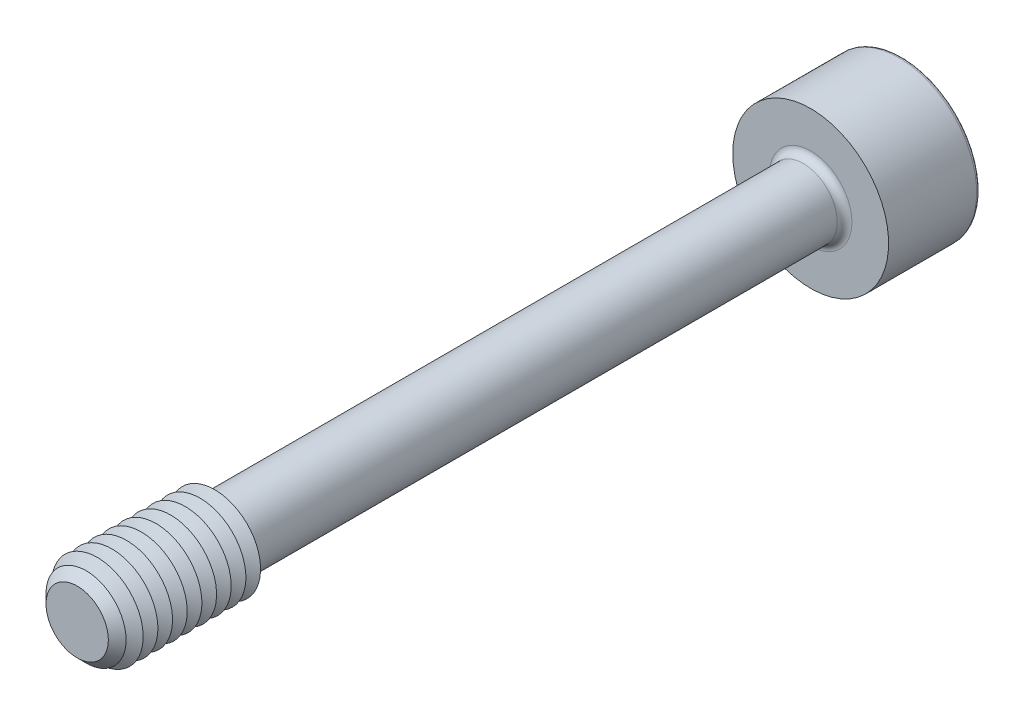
ISO-10303-21;
HEADER;
FILE_DESCRIPTION(('STEP AP214'),'2;1');
FILE_NAME('part.step','',(''),(''),'','','');
FILE_SCHEMA(('AUTOMOTIVE_DESIGN { 1 0 10303 214 1 1 1 1 }'));
ENDSEC;
DATA;
#1=APPLICATION_CONTEXT('core data for automotive mechanical design processes');
#2=APPLICATION_PROTOCOL_DEFINITION('international standard','automotive_design',2000,#1);
#3=PRODUCT_CONTEXT('',#1,'mechanical');
#4=PRODUCT('Part','Part','',(#3));
#5=PRODUCT_RELATED_PRODUCT_CATEGORY('part','',(#4));
#6=PRODUCT_DEFINITION_FORMATION('','',#4);
#7=PRODUCT_DEFINITION_CONTEXT('part definition',#1,'design');
#8=PRODUCT_DEFINITION('design','',#6,#7);
#9=PRODUCT_DEFINITION_SHAPE('','',#8);
#10=(LENGTH_UNIT() NAMED_UNIT(*) SI_UNIT(.MILLI.,.METRE.));
#11=(NAMED_UNIT(*) PLANE_ANGLE_UNIT() SI_UNIT($,.RADIAN.));
#12=(NAMED_UNIT(*) SI_UNIT($,.STERADIAN.) SOLID_ANGLE_UNIT());
#13=UNCERTAINTY_MEASURE_WITH_UNIT(LENGTH_MEASURE(1.E-05),#10,'distance_accuracy_value','');
#14=(GEOMETRIC_REPRESENTATION_CONTEXT(3) GLOBAL_UNCERTAINTY_ASSIGNED_CONTEXT((#13)) GLOBAL_UNIT_ASSIGNED_CONTEXT((#10,
#11,#12)) REPRESENTATION_CONTEXT('',''));
#15=CARTESIAN_POINT('',(0.,0.,0.));
#16=DIRECTION('',(0.,0.,1.));
#17=DIRECTION('',(1.,0.,0.));
#18=AXIS2_PLACEMENT_3D('',#15,#16,#17);
#19=CARTESIAN_POINT('',(-1.15470053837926,-2.,-21.));
#20=DIRECTION('',(0.,0.,1.));
#21=DIRECTION('',(1.,0.,0.));
#22=AXIS2_PLACEMENT_3D('',#19,#20,#21);
#23=PLANE('',#22);
#24=DIRECTION('',(1.,0.,0.));
#25=VECTOR('',#24,1.);
#26=CARTESIAN_POINT('',(-1.15470053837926,-2.,-21.));
#27=LINE('',#26,#25);
#28=CARTESIAN_POINT('',(0.,-2.,-21.));
#29=VERTEX_POINT('',#28);
#30=CARTESIAN_POINT('',(1.15470053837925,-2.,-21.));
#31=VERTEX_POINT('',#30);
#32=EDGE_CURVE('E794',#29,#31,#27,.T.);
#33=ORIENTED_EDGE('',*,*,#32,.F.);
#34=CARTESIAN_POINT('',(0.,0.,-21.));
#35=DIRECTION('',(0.,0.,1.));
#36=DIRECTION('',(0.,-1.,0.));
#37=AXIS2_PLACEMENT_3D('',#34,#35,#36);
#38=CIRCLE('',#37,2.);
#39=CARTESIAN_POINT('',(1.73205080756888,-0.999999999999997,-21.));
#40=VERTEX_POINT('',#39);
#41=EDGE_CURVE('E53',#29,#40,#38,.T.);
#42=ORIENTED_EDGE('',*,*,#41,.T.);
#43=DIRECTION('',(0.5,0.866025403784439,0.));
#44=VECTOR('',#43,1.);
#45=CARTESIAN_POINT('',(1.15470053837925,-2.,-21.));
#46=LINE('',#45,#44);
#47=EDGE_CURVE('E780',#31,#40,#46,.T.);
#48=ORIENTED_EDGE('',*,*,#47,.F.);
#49=EDGE_LOOP('',(#33,#42,#48));
#50=FACE_BOUND('',#49,.T.);
#51=ADVANCED_FACE('F41',(#50),#23,.F.);
#52=CARTESIAN_POINT('',(2.3094010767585,0.,-21.));
#53=VERTEX_POINT('',#52);
#54=EDGE_CURVE('E791',#40,#53,#46,.T.);
#55=ORIENTED_EDGE('',*,*,#54,.F.);
#56=CARTESIAN_POINT('',(1.73205080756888,1.,-21.));
#57=VERTEX_POINT('',#56);
#58=EDGE_CURVE('E11',#40,#57,#38,.T.);
#59=ORIENTED_EDGE('',*,*,#58,.T.);
#60=DIRECTION('',(-0.499999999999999,0.866025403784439,0.));
#61=VECTOR('',#60,1.);
#62=CARTESIAN_POINT('',(2.3094010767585,0.,-21.));
#63=LINE('',#62,#61);
#64=EDGE_CURVE('E779',#53,#57,#63,.T.);
#65=ORIENTED_EDGE('',*,*,#64,.F.);
#66=EDGE_LOOP('',(#55,#59,#65));
#67=FACE_BOUND('',#66,.T.);
#68=ADVANCED_FACE('F133',(#67),#23,.F.);
#69=CARTESIAN_POINT('',(1.15470053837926,2.,-21.));
#70=VERTEX_POINT('',#69);
#71=EDGE_CURVE('E774',#57,#70,#63,.T.);
#72=ORIENTED_EDGE('',*,*,#71,.F.);
#73=CARTESIAN_POINT('',(0.,2.00000000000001,-21.));
#74=VERTEX_POINT('',#73);
#75=EDGE_CURVE('E51',#57,#74,#38,.T.);
#76=ORIENTED_EDGE('',*,*,#75,.T.);
#77=DIRECTION('',(-1.,0.,0.));
#78=VECTOR('',#77,1.);
#79=CARTESIAN_POINT('',(1.15470053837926,2.,-21.));
#80=LINE('',#79,#78);
#81=EDGE_CURVE('E177',#70,#74,#80,.T.);
#82=ORIENTED_EDGE('',*,*,#81,.F.);
#83=EDGE_LOOP('',(#72,#76,#82));
#84=FACE_BOUND('',#83,.T.);
#85=ADVANCED_FACE('F139',(#84),#23,.F.);
#86=CARTESIAN_POINT('',(-1.15470053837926,2.,-21.));
#87=VERTEX_POINT('',#86);
#88=EDGE_CURVE('E785',#74,#87,#80,.T.);
#89=ORIENTED_EDGE('',*,*,#88,.F.);
#90=CARTESIAN_POINT('',(-1.73205080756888,1.00000000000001,-21.));
#91=VERTEX_POINT('',#90);
#92=EDGE_CURVE('E264',#74,#91,#38,.T.);
#93=ORIENTED_EDGE('',*,*,#92,.T.);
#94=DIRECTION('',(-0.5,-0.866025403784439,0.));
#95=VECTOR('',#94,1.);
#96=CARTESIAN_POINT('',(-1.15470053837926,2.,-21.));
#97=LINE('',#96,#95);
#98=EDGE_CURVE('E176',#87,#91,#97,.T.);
#99=ORIENTED_EDGE('',*,*,#98,.F.);
#100=EDGE_LOOP('',(#89,#93,#99));
#101=FACE_BOUND('',#100,.T.);
#102=ADVANCED_FACE('F157',(#101),#23,.F.);
#103=CARTESIAN_POINT('',(-2.30940107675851,0.,-21.));
#104=VERTEX_POINT('',#103);
#105=EDGE_CURVE('E170',#91,#104,#97,.T.);
#106=ORIENTED_EDGE('',*,*,#105,.F.);
#107=CARTESIAN_POINT('',(-1.73205080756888,-0.999999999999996,-21.));
#108=VERTEX_POINT('',#107);
#109=EDGE_CURVE('E172',#91,#108,#38,.T.);
#110=ORIENTED_EDGE('',*,*,#109,.T.);
#111=DIRECTION('',(0.5,-0.866025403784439,0.));
#112=VECTOR('',#111,1.);
#113=CARTESIAN_POINT('',(-2.30940107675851,0.,-21.));
#114=LINE('',#113,#112);
#115=EDGE_CURVE('E174',#104,#108,#114,.T.);
#116=ORIENTED_EDGE('',*,*,#115,.F.);
#117=EDGE_LOOP('',(#106,#110,#116));
#118=FACE_BOUND('',#117,.T.);
#119=ADVANCED_FACE('F146',(#118),#23,.F.);
#120=CARTESIAN_POINT('',(0.,0.,-25.));
#121=DIRECTION('',(0.,0.,-1.));
#122=DIRECTION('',(-1.,0.,0.));
#123=AXIS2_PLACEMENT_3D('',#120,#121,#122);
#124=PLANE('',#123);
#125=CARTESIAN_POINT('',(0.,0.,-25.));
#126=DIRECTION('',(0.,0.,-1.));
#127=DIRECTION('',(-1.,0.,0.));
#128=AXIS2_PLACEMENT_3D('',#125,#126,#127);
#129=CIRCLE('',#128,4.05);
#130=CARTESIAN_POINT('',(-4.05,0.,-25.));
#131=VERTEX_POINT('',#130);
#132=EDGE_CURVE('E251',#131,#131,#129,.T.);
#133=ORIENTED_EDGE('',*,*,#132,.T.);
#134=EDGE_LOOP('',(#133));
#135=FACE_BOUND('',#134,.T.);
#136=DIRECTION('',(-0.5,-0.866025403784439,0.));
#137=VECTOR('',#136,1.);
#138=CARTESIAN_POINT('',(-1.15470053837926,2.,-25.));
#139=LINE('',#138,#137);
#140=CARTESIAN_POINT('',(-1.15470053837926,2.,-25.));
#141=VERTEX_POINT('',#140);
#142=CARTESIAN_POINT('',(-2.30940107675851,0.,-25.));
#143=VERTEX_POINT('',#142);
#144=EDGE_CURVE('E212',#141,#143,#139,.T.);
#145=ORIENTED_EDGE('',*,*,#144,.T.);
#146=DIRECTION('',(0.5,-0.866025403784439,0.));
#147=VECTOR('',#146,1.);
#148=CARTESIAN_POINT('',(-2.30940107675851,0.,-25.));
#149=LINE('',#148,#147);
#150=CARTESIAN_POINT('',(-1.15470053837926,-2.,-25.));
#151=VERTEX_POINT('',#150);
#152=EDGE_CURVE('E67',#143,#151,#149,.T.);
#153=ORIENTED_EDGE('',*,*,#152,.T.);
#154=DIRECTION('',(1.,0.,0.));
#155=VECTOR('',#154,1.);
#156=CARTESIAN_POINT('',(-1.15470053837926,-2.,-25.));
#157=LINE('',#156,#155);
#158=CARTESIAN_POINT('',(1.15470053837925,-2.,-25.));
#159=VERTEX_POINT('',#158);
#160=EDGE_CURVE('E196',#151,#159,#157,.T.);
#161=ORIENTED_EDGE('',*,*,#160,.T.);
#162=DIRECTION('',(0.5,0.866025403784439,0.));
#163=VECTOR('',#162,1.);
#164=CARTESIAN_POINT('',(1.15470053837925,-2.,-25.));
#165=LINE('',#164,#163);
#166=CARTESIAN_POINT('',(2.3094010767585,0.,-25.));
#167=VERTEX_POINT('',#166);
#168=EDGE_CURVE('E200',#159,#167,#165,.T.);
#169=ORIENTED_EDGE('',*,*,#168,.T.);
#170=DIRECTION('',(-0.499999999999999,0.866025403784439,0.));
#171=VECTOR('',#170,1.);
#172=CARTESIAN_POINT('',(2.3094010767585,0.,-25.));
#173=LINE('',#172,#171);
#174=CARTESIAN_POINT('',(1.15470053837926,2.,-25.));
#175=VERTEX_POINT('',#174);
#176=EDGE_CURVE('E204',#167,#175,#173,.T.);
#177=ORIENTED_EDGE('',*,*,#176,.T.);
#178=DIRECTION('',(-1.,0.,0.));
#179=VECTOR('',#178,1.);
#180=CARTESIAN_POINT('',(1.15470053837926,2.,-25.));
#181=LINE('',#180,#179);
#182=EDGE_CURVE('E208',#175,#141,#181,.T.);
#183=ORIENTED_EDGE('',*,*,#182,.T.);
#184=EDGE_LOOP('',(#145,#153,#161,#169,#177,#183));
#185=FACE_BOUND('',#184,.T.);
#186=ADVANCED_FACE('F156',(#135,#185),#124,.T.);
#187=CARTESIAN_POINT('',(0.,0.,20.));
#188=DIRECTION('',(0.,0.,-1.));
#189=DIRECTION('',(-1.,0.,0.));
#190=AXIS2_PLACEMENT_3D('',#187,#188,#189);
#191=CYLINDRICAL_SURFACE('',#190,1.85);
#192=CARTESIAN_POINT('',(0.,0.,-19.6));
#193=DIRECTION('',(0.,0.,-1.));
#194=DIRECTION('',(-1.,0.,0.));
#195=AXIS2_PLACEMENT_3D('',#192,#193,#194);
#196=CIRCLE('',#195,1.85);
#197=CARTESIAN_POINT('',(-1.85,0.,-19.6));
#198=VERTEX_POINT('',#197);
#199=EDGE_CURVE('E247',#198,#198,#196,.F.);
#200=ORIENTED_EDGE('',*,*,#199,.T.);
#201=EDGE_LOOP('',(#200));
#202=FACE_BOUND('',#201,.T.);
#203=CARTESIAN_POINT('',(0.,0.,12.1247223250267));
#204=DIRECTION('',(0.,0.,-1.));
#205=DIRECTION('',(0.,1.,0.));
#206=AXIS2_PLACEMENT_3D('',#203,#204,#205);
#207=CIRCLE('',#206,1.85);
#208=CARTESIAN_POINT('',(0.,1.85,12.1247223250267));
#209=VERTEX_POINT('',#208);
#210=EDGE_CURVE('E235',#209,#209,#207,.T.);
#211=ORIENTED_EDGE('',*,*,#210,.T.);
#212=EDGE_LOOP('',(#211));
#213=FACE_BOUND('',#212,.T.);
#214=ADVANCED_FACE('F163',(#202,#213),#191,.T.);
#215=CARTESIAN_POINT('',(0.,0.,12.1247223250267));
#216=DIRECTION('',(0.,0.,1.));
#217=DIRECTION('',(0.,-1.,0.));
#218=AXIS2_PLACEMENT_3D('',#215,#216,#217);
#219=CONICAL_SURFACE('',#218,1.85,1.0471975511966);
#220=CARTESIAN_POINT('',(0.,0.,12.5));
#221=DIRECTION('',(0.,0.,-1.));
#222=DIRECTION('',(-1.,0.,0.));
#223=AXIS2_PLACEMENT_3D('',#220,#221,#222);
#224=CIRCLE('',#223,2.5);
#225=CARTESIAN_POINT('',(-2.5,0.,12.5));
#226=VERTEX_POINT('',#225);
#227=EDGE_CURVE('E268',#226,#226,#224,.T.);
#228=ORIENTED_EDGE('',*,*,#227,.T.);
#229=EDGE_LOOP('',(#228));
#230=FACE_BOUND('',#229,.T.);
#231=ORIENTED_EDGE('',*,*,#210,.F.);
#232=EDGE_LOOP('',(#231));
#233=FACE_BOUND('',#232,.T.);
#234=ADVANCED_FACE('F535',(#230,#233),#219,.T.);
#235=CARTESIAN_POINT('',(0.,0.,-20.));
#236=DIRECTION('',(0.,0.,-1.));
#237=DIRECTION('',(-1.,0.,0.));
#238=AXIS2_PLACEMENT_3D('',#235,#236,#237);
#239=PLANE('',#238);
#240=CARTESIAN_POINT('',(0.,0.,-20.));
#241=DIRECTION('',(0.,0.,-1.));
#242=DIRECTION('',(-1.,0.,0.));
#243=AXIS2_PLACEMENT_3D('',#240,#241,#242);
#244=CIRCLE('',#243,2.25);
#245=CARTESIAN_POINT('',(-2.25,0.,-20.));
#246=VERTEX_POINT('',#245);
#247=EDGE_CURVE('E243',#246,#246,#244,.T.);
#248=ORIENTED_EDGE('',*,*,#247,.T.);
#249=EDGE_LOOP('',(#248));
#250=FACE_BOUND('',#249,.T.);
#251=CARTESIAN_POINT('',(0.,0.,-20.));
#252=DIRECTION('',(0.,0.,-1.));
#253=DIRECTION('',(-1.,0.,0.));
#254=AXIS2_PLACEMENT_3D('',#251,#252,#253);
#255=CIRCLE('',#254,4.25);
#256=CARTESIAN_POINT('',(-4.25,0.,-20.));
#257=VERTEX_POINT('',#256);
#258=EDGE_CURVE('E231',#257,#257,#255,.T.);
#259=ORIENTED_EDGE('',*,*,#258,.F.);
#260=EDGE_LOOP('',(#259));
#261=FACE_BOUND('',#260,.T.);
#262=ADVANCED_FACE('F528',(#250,#261),#239,.F.);
#263=CARTESIAN_POINT('',(0.,0.,-25.));
#264=DIRECTION('',(0.,0.,1.));
#265=DIRECTION('',(1.,0.,0.));
#266=AXIS2_PLACEMENT_3D('',#263,#264,#265);
#267=CYLINDRICAL_SURFACE('',#266,4.25);
#268=CARTESIAN_POINT('',(0.,0.,-24.8));
#269=DIRECTION('',(0.,0.,-1.));
#270=DIRECTION('',(-1.,0.,0.));
#271=AXIS2_PLACEMENT_3D('',#268,#269,#270);
#272=CIRCLE('',#271,4.25);
#273=CARTESIAN_POINT('',(-4.25,0.,-24.8));
#274=VERTEX_POINT('',#273);
#275=EDGE_CURVE('E254',#274,#274,#272,.F.);
#276=ORIENTED_EDGE('',*,*,#275,.T.);
#277=EDGE_LOOP('',(#276));
#278=FACE_BOUND('',#277,.T.);
#279=ORIENTED_EDGE('',*,*,#258,.T.);
#280=EDGE_LOOP('',(#279));
#281=FACE_BOUND('',#280,.T.);
#282=ADVANCED_FACE('F534',(#278,#281),#267,.T.);
#283=CARTESIAN_POINT('',(-2.30940107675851,0.,-21.));
#284=DIRECTION('',(0.866025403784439,0.5,0.));
#285=DIRECTION('',(-0.5,0.866025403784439,0.));
#286=AXIS2_PLACEMENT_3D('',#283,#284,#285);
#287=PLANE('',#286);
#288=ORIENTED_EDGE('',*,*,#152,.F.);
#289=DIRECTION('',(0.,0.,-1.));
#290=VECTOR('',#289,1.);
#291=CARTESIAN_POINT('',(-2.30940107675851,0.,-21.));
#292=LINE('',#291,#290);
#293=EDGE_CURVE('E186',#104,#143,#292,.T.);
#294=ORIENTED_EDGE('',*,*,#293,.F.);
#295=ORIENTED_EDGE('',*,*,#115,.T.);
#296=CARTESIAN_POINT('',(-1.15470053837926,-2.,-21.));
#297=VERTEX_POINT('',#296);
#298=EDGE_CURVE('E215',#108,#297,#114,.T.);
#299=ORIENTED_EDGE('',*,*,#298,.T.);
#300=DIRECTION('',(0.,0.,-1.));
#301=VECTOR('',#300,1.);
#302=CARTESIAN_POINT('',(-1.15470053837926,-2.,-21.));
#303=LINE('',#302,#301);
#304=EDGE_CURVE('E228',#297,#151,#303,.T.);
#305=ORIENTED_EDGE('',*,*,#304,.T.);
#306=EDGE_LOOP('',(#288,#294,#295,#299,#305));
#307=FACE_BOUND('',#306,.T.);
#308=ADVANCED_FACE('F546',(#307),#287,.T.);
#309=CARTESIAN_POINT('',(-1.15470053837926,-2.,-21.));
#310=DIRECTION('',(0.,1.,0.));
#311=DIRECTION('',(-1.,0.,0.));
#312=AXIS2_PLACEMENT_3D('',#309,#310,#311);
#313=PLANE('',#312);
#314=ORIENTED_EDGE('',*,*,#160,.F.);
#315=ORIENTED_EDGE('',*,*,#304,.F.);
#316=EDGE_CURVE('E792',#297,#29,#27,.T.);
#317=ORIENTED_EDGE('',*,*,#316,.T.);
#318=ORIENTED_EDGE('',*,*,#32,.T.);
#319=DIRECTION('',(0.,0.,-1.));
#320=VECTOR('',#319,1.);
#321=CARTESIAN_POINT('',(1.15470053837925,-2.,-21.));
#322=LINE('',#321,#320);
#323=EDGE_CURVE('E225',#31,#159,#322,.T.);
#324=ORIENTED_EDGE('',*,*,#323,.T.);
#325=EDGE_LOOP('',(#314,#315,#317,#318,#324));
#326=FACE_BOUND('',#325,.T.);
#327=ADVANCED_FACE('F562',(#326),#313,.T.);
#328=CARTESIAN_POINT('',(1.15470053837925,-2.,-21.));
#329=DIRECTION('',(-0.866025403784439,0.5,0.));
#330=DIRECTION('',(-0.5,-0.866025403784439,0.));
#331=AXIS2_PLACEMENT_3D('',#328,#329,#330);
#332=PLANE('',#331);
#333=ORIENTED_EDGE('',*,*,#168,.F.);
#334=ORIENTED_EDGE('',*,*,#323,.F.);
#335=ORIENTED_EDGE('',*,*,#47,.T.);
#336=ORIENTED_EDGE('',*,*,#54,.T.);
#337=DIRECTION('',(0.,0.,-1.));
#338=VECTOR('',#337,1.);
#339=CARTESIAN_POINT('',(2.3094010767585,0.,-21.));
#340=LINE('',#339,#338);
#341=EDGE_CURVE('E222',#53,#167,#340,.T.);
#342=ORIENTED_EDGE('',*,*,#341,.T.);
#343=EDGE_LOOP('',(#333,#334,#335,#336,#342));
#344=FACE_BOUND('',#343,.T.);
#345=ADVANCED_FACE('F572',(#344),#332,.T.);
#346=CARTESIAN_POINT('',(2.3094010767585,0.,-21.));
#347=DIRECTION('',(-0.866025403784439,-0.499999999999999,0.));
#348=DIRECTION('',(0.499999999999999,-0.866025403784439,0.));
#349=AXIS2_PLACEMENT_3D('',#346,#347,#348);
#350=PLANE('',#349);
#351=ORIENTED_EDGE('',*,*,#176,.F.);
#352=ORIENTED_EDGE('',*,*,#341,.F.);
#353=ORIENTED_EDGE('',*,*,#64,.T.);
#354=ORIENTED_EDGE('',*,*,#71,.T.);
#355=DIRECTION('',(0.,0.,-1.));
#356=VECTOR('',#355,1.);
#357=CARTESIAN_POINT('',(1.15470053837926,2.,-21.));
#358=LINE('',#357,#356);
#359=EDGE_CURVE('E219',#70,#175,#358,.T.);
#360=ORIENTED_EDGE('',*,*,#359,.T.);
#361=EDGE_LOOP('',(#351,#352,#353,#354,#360));
#362=FACE_BOUND('',#361,.T.);
#363=ADVANCED_FACE('F582',(#362),#350,.T.);
#364=CARTESIAN_POINT('',(1.15470053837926,2.,-21.));
#365=DIRECTION('',(0.,-1.,0.));
#366=DIRECTION('',(0.,0.,-1.));
#367=AXIS2_PLACEMENT_3D('',#364,#365,#366);
#368=PLANE('',#367);
#369=ORIENTED_EDGE('',*,*,#182,.F.);
#370=ORIENTED_EDGE('',*,*,#359,.F.);
#371=ORIENTED_EDGE('',*,*,#81,.T.);
#372=ORIENTED_EDGE('',*,*,#88,.T.);
#373=DIRECTION('',(0.,0.,-1.));
#374=VECTOR('',#373,1.);
#375=CARTESIAN_POINT('',(-1.15470053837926,2.,-21.));
#376=LINE('',#375,#374);
#377=EDGE_CURVE('E182',#87,#141,#376,.T.);
#378=ORIENTED_EDGE('',*,*,#377,.T.);
#379=EDGE_LOOP('',(#369,#370,#371,#372,#378));
#380=FACE_BOUND('',#379,.T.);
#381=ADVANCED_FACE('F152',(#380),#368,.T.);
#382=CARTESIAN_POINT('',(-1.15470053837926,2.,-21.));
#383=DIRECTION('',(0.866025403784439,-0.5,0.));
#384=DIRECTION('',(0.5,0.866025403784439,0.));
#385=AXIS2_PLACEMENT_3D('',#382,#383,#384);
#386=PLANE('',#385);
#387=ORIENTED_EDGE('',*,*,#144,.F.);
#388=ORIENTED_EDGE('',*,*,#377,.F.);
#389=ORIENTED_EDGE('',*,*,#98,.T.);
#390=ORIENTED_EDGE('',*,*,#105,.T.);
#391=ORIENTED_EDGE('',*,*,#293,.T.);
#392=EDGE_LOOP('',(#387,#388,#389,#390,#391));
#393=FACE_BOUND('',#392,.T.);
#394=ADVANCED_FACE('F144',(#393),#386,.T.);
#395=ORIENTED_EDGE('',*,*,#298,.F.);
#396=EDGE_CURVE('E257',#108,#29,#38,.T.);
#397=ORIENTED_EDGE('',*,*,#396,.T.);
#398=ORIENTED_EDGE('',*,*,#316,.F.);
#399=EDGE_LOOP('',(#395,#397,#398));
#400=FACE_BOUND('',#399,.T.);
#401=ADVANCED_FACE('F135',(#400),#23,.F.);
#402=CARTESIAN_POINT('',(0.,0.,-19.6));
#403=DIRECTION('',(0.,0.,-1.));
#404=DIRECTION('',(-1.,0.,0.));
#405=AXIS2_PLACEMENT_3D('',#402,#403,#404);
#406=TOROIDAL_SURFACE('',#405,2.25,0.4);
#407=ORIENTED_EDGE('',*,*,#199,.F.);
#408=EDGE_LOOP('',(#407));
#409=FACE_BOUND('',#408,.T.);
#410=ORIENTED_EDGE('',*,*,#247,.F.);
#411=EDGE_LOOP('',(#410));
#412=FACE_BOUND('',#411,.T.);
#413=ADVANCED_FACE('F129',(#409,#412),#406,.F.);
#414=CARTESIAN_POINT('',(0.,0.,-24.8));
#415=DIRECTION('',(0.,0.,-1.));
#416=DIRECTION('',(-1.,0.,0.));
#417=AXIS2_PLACEMENT_3D('',#414,#415,#416);
#418=TOROIDAL_SURFACE('',#417,4.05,0.2);
#419=ORIENTED_EDGE('',*,*,#275,.F.);
#420=EDGE_LOOP('',(#419));
#421=FACE_BOUND('',#420,.T.);
#422=ORIENTED_EDGE('',*,*,#132,.F.);
#423=EDGE_LOOP('',(#422));
#424=FACE_BOUND('',#423,.T.);
#425=ADVANCED_FACE('F43',(#421,#424),#418,.T.);
#426=CARTESIAN_POINT('',(0.,0.,-19.8452994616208));
#427=DIRECTION('',(0.,0.,-1.));
#428=DIRECTION('',(0.,1.,0.));
#429=AXIS2_PLACEMENT_3D('',#426,#427,#428);
#430=CONICAL_SURFACE('',#429,0.,1.04719755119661);
#431=ORIENTED_EDGE('',*,*,#41,.F.);
#432=ORIENTED_EDGE('',*,*,#396,.F.);
#433=ORIENTED_EDGE('',*,*,#109,.F.);
#434=ORIENTED_EDGE('',*,*,#92,.F.);
#435=ORIENTED_EDGE('',*,*,#75,.F.);
#436=ORIENTED_EDGE('',*,*,#58,.F.);
#437=EDGE_LOOP('',(#431,#432,#433,#434,#435,#436));
#438=FACE_BOUND('',#437,.T.);
#439=CARTESIAN_POINT('',(0.,0.,-19.8452994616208));
#440=VERTEX_POINT('',#439);
#441=VERTEX_LOOP('',#440);
#442=FACE_BOUND('',#441,.T.);
#443=ADVANCED_FACE('F118',(#438,#442),#430,.F.);
#444=CARTESIAN_POINT('',(0.,0.,12.9));
#445=DIRECTION('',(0.,0.,-1.));
#446=DIRECTION('',(-1.,0.,0.));
#447=AXIS2_PLACEMENT_3D('',#444,#445,#446);
#448=CONICAL_SURFACE('',#447,1.80717967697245,1.0471975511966);
#449=ORIENTED_EDGE('',*,*,#227,.F.);
#450=EDGE_LOOP('',(#449));
#451=FACE_BOUND('',#450,.T.);
#452=CARTESIAN_POINT('',(0.,0.,12.9));
#453=DIRECTION('',(0.,0.,-1.));
#454=DIRECTION('',(-1.,0.,0.));
#455=AXIS2_PLACEMENT_3D('',#452,#453,#454);
#456=CIRCLE('',#455,1.80717967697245);
#457=CARTESIAN_POINT('',(-1.80717967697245,0.,12.9));
#458=VERTEX_POINT('',#457);
#459=EDGE_CURVE('E272',#458,#458,#456,.T.);
#460=ORIENTED_EDGE('',*,*,#459,.T.);
#461=EDGE_LOOP('',(#460));
#462=FACE_BOUND('',#461,.T.);
#463=ADVANCED_FACE('F120',(#451,#462),#448,.T.);
#464=CARTESIAN_POINT('',(0.,0.,13.3));
#465=DIRECTION('',(0.,0.,1.));
#466=DIRECTION('',(1.,0.,0.));
#467=AXIS2_PLACEMENT_3D('',#464,#465,#466);
#468=CONICAL_SURFACE('',#467,2.5,1.0471975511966);
#469=ORIENTED_EDGE('',*,*,#459,.F.);
#470=EDGE_LOOP('',(#469));
#471=FACE_BOUND('',#470,.T.);
#472=CARTESIAN_POINT('',(0.,0.,13.3));
#473=DIRECTION('',(0.,0.,-1.));
#474=DIRECTION('',(-1.,0.,0.));
#475=AXIS2_PLACEMENT_3D('',#472,#473,#474);
#476=CIRCLE('',#475,2.5);
#477=CARTESIAN_POINT('',(-2.5,0.,13.3));
#478=VERTEX_POINT('',#477);
#479=EDGE_CURVE('E277',#478,#478,#476,.T.);
#480=ORIENTED_EDGE('',*,*,#479,.T.);
#481=EDGE_LOOP('',(#480));
#482=FACE_BOUND('',#481,.T.);
#483=ADVANCED_FACE('F126',(#471,#482),#468,.T.);
#484=CARTESIAN_POINT('',(0.,0.,13.7));
#485=DIRECTION('',(0.,0.,-1.));
#486=DIRECTION('',(-1.,0.,0.));
#487=AXIS2_PLACEMENT_3D('',#484,#485,#486);
#488=CONICAL_SURFACE('',#487,1.80717967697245,1.0471975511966);
#489=ORIENTED_EDGE('',*,*,#479,.F.);
#490=EDGE_LOOP('',(#489));
#491=FACE_BOUND('',#490,.T.);
#492=CARTESIAN_POINT('',(0.,0.,13.7));
#493=DIRECTION('',(0.,0.,-1.));
#494=DIRECTION('',(-1.,0.,0.));
#495=AXIS2_PLACEMENT_3D('',#492,#493,#494);
#496=CIRCLE('',#495,1.80717967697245);
#497=CARTESIAN_POINT('',(-1.80717967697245,0.,13.7));
#498=VERTEX_POINT('',#497);
#499=EDGE_CURVE('E283',#498,#498,#496,.T.);
#500=ORIENTED_EDGE('',*,*,#499,.T.);
#501=EDGE_LOOP('',(#500));
#502=FACE_BOUND('',#501,.T.);
#503=ADVANCED_FACE('F412',(#491,#502),#488,.T.);
#504=CARTESIAN_POINT('',(0.,0.,14.1));
#505=DIRECTION('',(0.,0.,1.));
#506=DIRECTION('',(1.,0.,0.));
#507=AXIS2_PLACEMENT_3D('',#504,#505,#506);
#508=CONICAL_SURFACE('',#507,2.5,1.0471975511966);
#509=ORIENTED_EDGE('',*,*,#499,.F.);
#510=EDGE_LOOP('',(#509));
#511=FACE_BOUND('',#510,.T.);
#512=CARTESIAN_POINT('',(0.,0.,14.1));
#513=DIRECTION('',(0.,0.,-1.));
#514=DIRECTION('',(-1.,0.,0.));
#515=AXIS2_PLACEMENT_3D('',#512,#513,#514);
#516=CIRCLE('',#515,2.5);
#517=CARTESIAN_POINT('',(-2.5,0.,14.1));
#518=VERTEX_POINT('',#517);
#519=EDGE_CURVE('E287',#518,#518,#516,.T.);
#520=ORIENTED_EDGE('',*,*,#519,.T.);
#521=EDGE_LOOP('',(#520));
#522=FACE_BOUND('',#521,.T.);
#523=ADVANCED_FACE('F408',(#511,#522),#508,.T.);
#524=CARTESIAN_POINT('',(0.,0.,14.5));
#525=DIRECTION('',(0.,0.,-1.));
#526=DIRECTION('',(-1.,0.,0.));
#527=AXIS2_PLACEMENT_3D('',#524,#525,#526);
#528=CONICAL_SURFACE('',#527,1.80717967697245,1.0471975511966);
#529=ORIENTED_EDGE('',*,*,#519,.F.);
#530=EDGE_LOOP('',(#529));
#531=FACE_BOUND('',#530,.T.);
#532=CARTESIAN_POINT('',(0.,0.,14.5));
#533=DIRECTION('',(0.,0.,-1.));
#534=DIRECTION('',(-1.,0.,0.));
#535=AXIS2_PLACEMENT_3D('',#532,#533,#534);
#536=CIRCLE('',#535,1.80717967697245);
#537=CARTESIAN_POINT('',(-1.80717967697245,0.,14.5));
#538=VERTEX_POINT('',#537);
#539=EDGE_CURVE('E291',#538,#538,#536,.T.);
#540=ORIENTED_EDGE('',*,*,#539,.T.);
#541=EDGE_LOOP('',(#540));
#542=FACE_BOUND('',#541,.T.);
#543=ADVANCED_FACE('F404',(#531,#542),#528,.T.);
#544=CARTESIAN_POINT('',(0.,0.,14.9));
#545=DIRECTION('',(0.,0.,1.));
#546=DIRECTION('',(1.,0.,0.));
#547=AXIS2_PLACEMENT_3D('',#544,#545,#546);
#548=CONICAL_SURFACE('',#547,2.5,1.0471975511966);
#549=ORIENTED_EDGE('',*,*,#539,.F.);
#550=EDGE_LOOP('',(#549));
#551=FACE_BOUND('',#550,.T.);
#552=CARTESIAN_POINT('',(0.,0.,14.9));
#553=DIRECTION('',(0.,0.,-1.));
#554=DIRECTION('',(-1.,0.,0.));
#555=AXIS2_PLACEMENT_3D('',#552,#553,#554);
#556=CIRCLE('',#555,2.5);
#557=CARTESIAN_POINT('',(-2.5,0.,14.9));
#558=VERTEX_POINT('',#557);
#559=EDGE_CURVE('E295',#558,#558,#556,.T.);
#560=ORIENTED_EDGE('',*,*,#559,.T.);
#561=EDGE_LOOP('',(#560));
#562=FACE_BOUND('',#561,.T.);
#563=ADVANCED_FACE('F400',(#551,#562),#548,.T.);
#564=CARTESIAN_POINT('',(0.,0.,15.3));
#565=DIRECTION('',(0.,0.,-1.));
#566=DIRECTION('',(-1.,0.,0.));
#567=AXIS2_PLACEMENT_3D('',#564,#565,#566);
#568=CONICAL_SURFACE('',#567,1.80717967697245,1.0471975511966);
#569=ORIENTED_EDGE('',*,*,#559,.F.);
#570=EDGE_LOOP('',(#569));
#571=FACE_BOUND('',#570,.T.);
#572=CARTESIAN_POINT('',(0.,0.,15.3));
#573=DIRECTION('',(0.,0.,-1.));
#574=DIRECTION('',(-1.,0.,0.));
#575=AXIS2_PLACEMENT_3D('',#572,#573,#574);
#576=CIRCLE('',#575,1.80717967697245);
#577=CARTESIAN_POINT('',(-1.80717967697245,0.,15.3));
#578=VERTEX_POINT('',#577);
#579=EDGE_CURVE('E299',#578,#578,#576,.T.);
#580=ORIENTED_EDGE('',*,*,#579,.T.);
#581=EDGE_LOOP('',(#580));
#582=FACE_BOUND('',#581,.T.);
#583=ADVANCED_FACE('F396',(#571,#582),#568,.T.);
#584=CARTESIAN_POINT('',(0.,0.,15.7));
#585=DIRECTION('',(0.,0.,1.));
#586=DIRECTION('',(1.,0.,0.));
#587=AXIS2_PLACEMENT_3D('',#584,#585,#586);
#588=CONICAL_SURFACE('',#587,2.5,1.0471975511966);
#589=ORIENTED_EDGE('',*,*,#579,.F.);
#590=EDGE_LOOP('',(#589));
#591=FACE_BOUND('',#590,.T.);
#592=CARTESIAN_POINT('',(0.,0.,15.7));
#593=DIRECTION('',(0.,0.,-1.));
#594=DIRECTION('',(-1.,0.,0.));
#595=AXIS2_PLACEMENT_3D('',#592,#593,#594);
#596=CIRCLE('',#595,2.5);
#597=CARTESIAN_POINT('',(-2.5,0.,15.7));
#598=VERTEX_POINT('',#597);
#599=EDGE_CURVE('E303',#598,#598,#596,.T.);
#600=ORIENTED_EDGE('',*,*,#599,.T.);
#601=EDGE_LOOP('',(#600));
#602=FACE_BOUND('',#601,.T.);
#603=ADVANCED_FACE('F392',(#591,#602),#588,.T.);
#604=CARTESIAN_POINT('',(0.,0.,16.1));
#605=DIRECTION('',(0.,0.,-1.));
#606=DIRECTION('',(-1.,0.,0.));
#607=AXIS2_PLACEMENT_3D('',#604,#605,#606);
#608=CONICAL_SURFACE('',#607,1.80717967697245,1.0471975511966);
#609=ORIENTED_EDGE('',*,*,#599,.F.);
#610=EDGE_LOOP('',(#609));
#611=FACE_BOUND('',#610,.T.);
#612=CARTESIAN_POINT('',(0.,0.,16.1));
#613=DIRECTION('',(0.,0.,-1.));
#614=DIRECTION('',(-1.,0.,0.));
#615=AXIS2_PLACEMENT_3D('',#612,#613,#614);
#616=CIRCLE('',#615,1.80717967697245);
#617=CARTESIAN_POINT('',(-1.80717967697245,0.,16.1));
#618=VERTEX_POINT('',#617);
#619=EDGE_CURVE('E307',#618,#618,#616,.T.);
#620=ORIENTED_EDGE('',*,*,#619,.T.);
#621=EDGE_LOOP('',(#620));
#622=FACE_BOUND('',#621,.T.);
#623=ADVANCED_FACE('F388',(#611,#622),#608,.T.);
#624=CARTESIAN_POINT('',(0.,0.,16.5));
#625=DIRECTION('',(0.,0.,1.));
#626=DIRECTION('',(1.,0.,0.));
#627=AXIS2_PLACEMENT_3D('',#624,#625,#626);
#628=CONICAL_SURFACE('',#627,2.5,1.0471975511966);
#629=ORIENTED_EDGE('',*,*,#619,.F.);
#630=EDGE_LOOP('',(#629));
#631=FACE_BOUND('',#630,.T.);
#632=CARTESIAN_POINT('',(0.,0.,16.5));
#633=DIRECTION('',(0.,0.,-1.));
#634=DIRECTION('',(-1.,0.,0.));
#635=AXIS2_PLACEMENT_3D('',#632,#633,#634);
#636=CIRCLE('',#635,2.5);
#637=CARTESIAN_POINT('',(-2.5,0.,16.5));
#638=VERTEX_POINT('',#637);
#639=EDGE_CURVE('E310',#638,#638,#636,.T.);
#640=ORIENTED_EDGE('',*,*,#639,.T.);
#641=EDGE_LOOP('',(#640));
#642=FACE_BOUND('',#641,.T.);
#643=ADVANCED_FACE('F384',(#631,#642),#628,.T.);
#644=CARTESIAN_POINT('',(0.,0.,16.9));
#645=DIRECTION('',(0.,0.,-1.));
#646=DIRECTION('',(-1.,0.,0.));
#647=AXIS2_PLACEMENT_3D('',#644,#645,#646);
#648=CONICAL_SURFACE('',#647,1.80717967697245,1.0471975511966);
#649=ORIENTED_EDGE('',*,*,#639,.F.);
#650=EDGE_LOOP('',(#649));
#651=FACE_BOUND('',#650,.T.);
#652=CARTESIAN_POINT('',(0.,0.,16.9));
#653=DIRECTION('',(0.,0.,-1.));
#654=DIRECTION('',(-1.,0.,0.));
#655=AXIS2_PLACEMENT_3D('',#652,#653,#654);
#656=CIRCLE('',#655,1.80717967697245);
#657=CARTESIAN_POINT('',(-1.80717967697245,0.,16.9));
#658=VERTEX_POINT('',#657);
#659=EDGE_CURVE('E314',#658,#658,#656,.T.);
#660=ORIENTED_EDGE('',*,*,#659,.T.);
#661=EDGE_LOOP('',(#660));
#662=FACE_BOUND('',#661,.T.);
#663=ADVANCED_FACE('F380',(#651,#662),#648,.T.);
#664=CARTESIAN_POINT('',(0.,0.,17.3));
#665=DIRECTION('',(0.,0.,1.));
#666=DIRECTION('',(1.,0.,0.));
#667=AXIS2_PLACEMENT_3D('',#664,#665,#666);
#668=CONICAL_SURFACE('',#667,2.5,1.0471975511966);
#669=ORIENTED_EDGE('',*,*,#659,.F.);
#670=EDGE_LOOP('',(#669));
#671=FACE_BOUND('',#670,.T.);
#672=CARTESIAN_POINT('',(0.,0.,17.3));
#673=DIRECTION('',(0.,0.,-1.));
#674=DIRECTION('',(-1.,0.,0.));
#675=AXIS2_PLACEMENT_3D('',#672,#673,#674);
#676=CIRCLE('',#675,2.5);
#677=CARTESIAN_POINT('',(-2.5,0.,17.3));
#678=VERTEX_POINT('',#677);
#679=EDGE_CURVE('E318',#678,#678,#676,.T.);
#680=ORIENTED_EDGE('',*,*,#679,.T.);
#681=EDGE_LOOP('',(#680));
#682=FACE_BOUND('',#681,.T.);
#683=ADVANCED_FACE('F376',(#671,#682),#668,.T.);
#684=CARTESIAN_POINT('',(0.,0.,17.7));
#685=DIRECTION('',(0.,0.,-1.));
#686=DIRECTION('',(-1.,0.,0.));
#687=AXIS2_PLACEMENT_3D('',#684,#685,#686);
#688=CONICAL_SURFACE('',#687,1.80717967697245,1.0471975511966);
#689=ORIENTED_EDGE('',*,*,#679,.F.);
#690=EDGE_LOOP('',(#689));
#691=FACE_BOUND('',#690,.T.);
#692=CARTESIAN_POINT('',(0.,0.,17.7));
#693=DIRECTION('',(0.,0.,-1.));
#694=DIRECTION('',(-1.,0.,0.));
#695=AXIS2_PLACEMENT_3D('',#692,#693,#694);
#696=CIRCLE('',#695,1.80717967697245);
#697=CARTESIAN_POINT('',(-1.80717967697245,0.,17.7));
#698=VERTEX_POINT('',#697);
#699=EDGE_CURVE('E321',#698,#698,#696,.T.);
#700=ORIENTED_EDGE('',*,*,#699,.T.);
#701=EDGE_LOOP('',(#700));
#702=FACE_BOUND('',#701,.T.);
#703=ADVANCED_FACE('F372',(#691,#702),#688,.T.);
#704=CARTESIAN_POINT('',(0.,0.,18.1));
#705=DIRECTION('',(0.,0.,1.));
#706=DIRECTION('',(1.,0.,0.));
#707=AXIS2_PLACEMENT_3D('',#704,#705,#706);
#708=CONICAL_SURFACE('',#707,2.5,1.0471975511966);
#709=ORIENTED_EDGE('',*,*,#699,.F.);
#710=EDGE_LOOP('',(#709));
#711=FACE_BOUND('',#710,.T.);
#712=CARTESIAN_POINT('',(0.,0.,18.1));
#713=DIRECTION('',(0.,0.,-1.));
#714=DIRECTION('',(-1.,0.,0.));
#715=AXIS2_PLACEMENT_3D('',#712,#713,#714);
#716=CIRCLE('',#715,2.5);
#717=CARTESIAN_POINT('',(-2.5,0.,18.1));
#718=VERTEX_POINT('',#717);
#719=EDGE_CURVE('E325',#718,#718,#716,.T.);
#720=ORIENTED_EDGE('',*,*,#719,.T.);
#721=EDGE_LOOP('',(#720));
#722=FACE_BOUND('',#721,.T.);
#723=ADVANCED_FACE('F368',(#711,#722),#708,.T.);
#724=CARTESIAN_POINT('',(0.,0.,18.5));
#725=DIRECTION('',(0.,0.,-1.));
#726=DIRECTION('',(-1.,0.,0.));
#727=AXIS2_PLACEMENT_3D('',#724,#725,#726);
#728=CONICAL_SURFACE('',#727,1.80717967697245,1.0471975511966);
#729=ORIENTED_EDGE('',*,*,#719,.F.);
#730=EDGE_LOOP('',(#729));
#731=FACE_BOUND('',#730,.T.);
#732=CARTESIAN_POINT('',(0.,0.,18.5));
#733=DIRECTION('',(0.,0.,-1.));
#734=DIRECTION('',(-1.,0.,0.));
#735=AXIS2_PLACEMENT_3D('',#732,#733,#734);
#736=CIRCLE('',#735,1.80717967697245);
#737=CARTESIAN_POINT('',(-1.80717967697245,0.,18.5));
#738=VERTEX_POINT('',#737);
#739=EDGE_CURVE('E329',#738,#738,#736,.T.);
#740=ORIENTED_EDGE('',*,*,#739,.T.);
#741=EDGE_LOOP('',(#740));
#742=FACE_BOUND('',#741,.T.);
#743=ADVANCED_FACE('F364',(#731,#742),#728,.T.);
#744=CARTESIAN_POINT('',(0.,0.,18.9));
#745=DIRECTION('',(0.,0.,1.));
#746=DIRECTION('',(1.,0.,0.));
#747=AXIS2_PLACEMENT_3D('',#744,#745,#746);
#748=CONICAL_SURFACE('',#747,2.5,1.0471975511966);
#749=ORIENTED_EDGE('',*,*,#739,.F.);
#750=EDGE_LOOP('',(#749));
#751=FACE_BOUND('',#750,.T.);
#752=CARTESIAN_POINT('',(0.,0.,18.9));
#753=DIRECTION('',(0.,0.,-1.));
#754=DIRECTION('',(-1.,0.,0.));
#755=AXIS2_PLACEMENT_3D('',#752,#753,#754);
#756=CIRCLE('',#755,2.5);
#757=CARTESIAN_POINT('',(-2.5,0.,18.9));
#758=VERTEX_POINT('',#757);
#759=EDGE_CURVE('E333',#758,#758,#756,.T.);
#760=ORIENTED_EDGE('',*,*,#759,.T.);
#761=EDGE_LOOP('',(#760));
#762=FACE_BOUND('',#761,.T.);
#763=ADVANCED_FACE('F357',(#751,#762),#748,.T.);
#764=CARTESIAN_POINT('',(0.,0.,19.3));
#765=DIRECTION('',(0.,0.,-1.));
#766=DIRECTION('',(-1.,0.,0.));
#767=AXIS2_PLACEMENT_3D('',#764,#765,#766);
#768=CONICAL_SURFACE('',#767,1.80717967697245,1.0471975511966);
#769=ORIENTED_EDGE('',*,*,#759,.F.);
#770=EDGE_LOOP('',(#769));
#771=FACE_BOUND('',#770,.T.);
#772=CARTESIAN_POINT('',(0.,0.,19.3));
#773=DIRECTION('',(0.,0.,-1.));
#774=DIRECTION('',(-1.,0.,0.));
#775=AXIS2_PLACEMENT_3D('',#772,#773,#774);
#776=CIRCLE('',#775,1.80717967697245);
#777=CARTESIAN_POINT('',(-1.80717967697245,0.,19.3));
#778=VERTEX_POINT('',#777);
#779=EDGE_CURVE('E337',#778,#778,#776,.T.);
#780=ORIENTED_EDGE('',*,*,#779,.T.);
#781=EDGE_LOOP('',(#780));
#782=FACE_BOUND('',#781,.T.);
#783=ADVANCED_FACE('F343',(#771,#782),#768,.T.);
#784=CARTESIAN_POINT('',(0.,0.,19.7));
#785=DIRECTION('',(0.,0.,1.));
#786=DIRECTION('',(1.,0.,0.));
#787=AXIS2_PLACEMENT_3D('',#784,#785,#786);
#788=CONICAL_SURFACE('',#787,2.5,1.0471975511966);
#789=CARTESIAN_POINT('',(0.,0.,19.5169872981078));
#790=DIRECTION('',(0.,0.,1.));
#791=DIRECTION('',(1.,0.,0.));
#792=AXIS2_PLACEMENT_3D('',#789,#790,#791);
#793=CIRCLE('',#792,2.18301270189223);
#794=CARTESIAN_POINT('',(2.18301270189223,0.,19.5169872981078));
#795=VERTEX_POINT('',#794);
#796=EDGE_CURVE('E45',#795,#795,#793,.F.);
#797=ORIENTED_EDGE('',*,*,#796,.T.);
#798=EDGE_LOOP('',(#797));
#799=FACE_BOUND('',#798,.T.);
#800=ORIENTED_EDGE('',*,*,#779,.F.);
#801=EDGE_LOOP('',(#800));
#802=FACE_BOUND('',#801,.T.);
#803=ADVANCED_FACE('F345',(#799,#802),#788,.T.);
#804=CARTESIAN_POINT('',(0.,0.,20.));
#805=DIRECTION('',(0.,0.,1.));
#806=DIRECTION('',(1.,0.,0.));
#807=AXIS2_PLACEMENT_3D('',#804,#805,#806);
#808=PLANE('',#807);
#809=CARTESIAN_POINT('',(0.,0.,20.));
#810=DIRECTION('',(0.,0.,1.));
#811=DIRECTION('',(1.,0.,0.));
#812=AXIS2_PLACEMENT_3D('',#809,#810,#811);
#813=CIRCLE('',#812,1.70000000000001);
#814=CARTESIAN_POINT('',(1.70000000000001,0.,20.));
#815=VERTEX_POINT('',#814);
#816=EDGE_CURVE('E239',#815,#815,#813,.T.);
#817=ORIENTED_EDGE('',*,*,#816,.T.);
#818=EDGE_LOOP('',(#817));
#819=FACE_BOUND('',#818,.T.);
#820=ADVANCED_FACE('F347',(#819),#808,.T.);
#821=CARTESIAN_POINT('',(0.,0.,19.2));
#822=DIRECTION('',(0.,0.,-1.));
#823=DIRECTION('',(0.,1.,0.));
#824=AXIS2_PLACEMENT_3D('',#821,#822,#823);
#825=CONICAL_SURFACE('',#824,2.5,0.785398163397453);
#826=ORIENTED_EDGE('',*,*,#796,.F.);
#827=EDGE_LOOP('',(#826));
#828=FACE_BOUND('',#827,.T.);
#829=ORIENTED_EDGE('',*,*,#816,.F.);
#830=EDGE_LOOP('',(#829));
#831=FACE_BOUND('',#830,.T.);
#832=ADVANCED_FACE('F354',(#828,#831),#825,.T.);
#833=CLOSED_SHELL('',(#51,#68,#85,#102,#119,#186,#214,#234,#262,#282,#308,#327,#345,#363,#381,
#394,#401,#413,#425,#443,#463,#483,#503,#523,#543,#563,#583,#603,#623,#643,#663,#683,#703,#723,
#743,#763,#783,#803,#820,#832));
#834=MANIFOLD_SOLID_BREP('B2',#833);
#835=ADVANCED_BREP_SHAPE_REPRESENTATION('',(#18,#834),#14);
#836=SHAPE_DEFINITION_REPRESENTATION(#9,#835);
ENDSEC;
END-ISO-10303-21;
